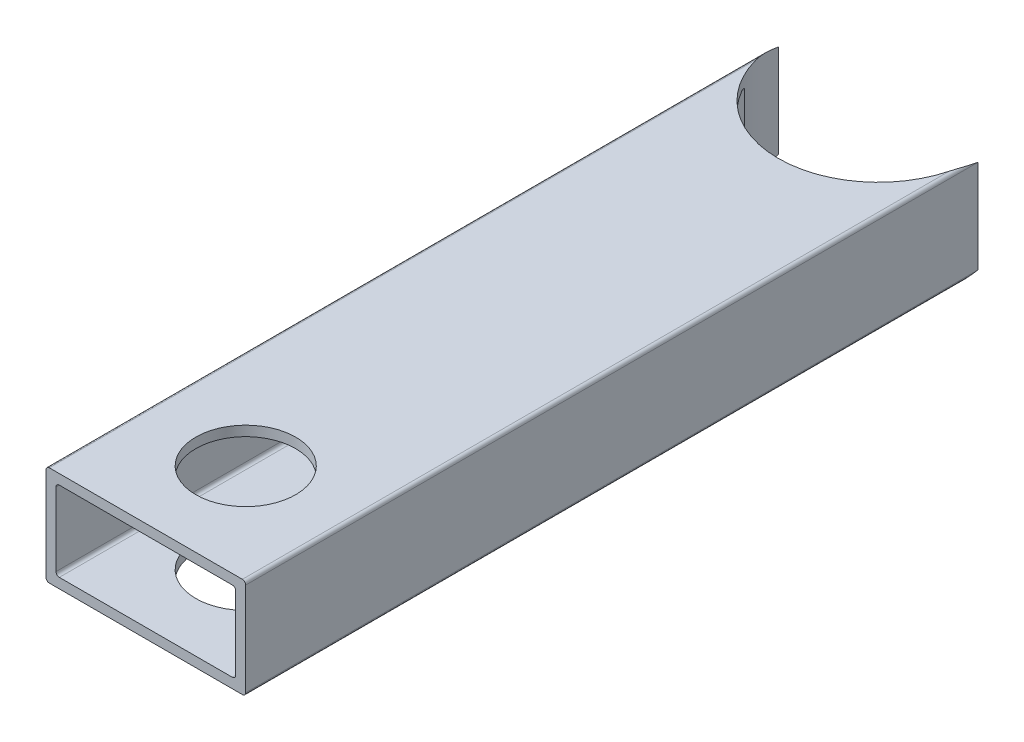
ISO-10303-21;
HEADER;
FILE_DESCRIPTION(('STEP AP214'),'2;1');
FILE_NAME('part.step','',(''),(''),'','','');
FILE_SCHEMA(('AUTOMOTIVE_DESIGN { 1 0 10303 214 1 1 1 1 }'));
ENDSEC;
DATA;
#1=APPLICATION_CONTEXT('core data for automotive mechanical design processes');
#2=APPLICATION_PROTOCOL_DEFINITION('international standard','automotive_design',2000,#1);
#3=PRODUCT_CONTEXT('',#1,'mechanical');
#4=PRODUCT('Part','Part','',(#3));
#5=PRODUCT_RELATED_PRODUCT_CATEGORY('part','',(#4));
#6=PRODUCT_DEFINITION_FORMATION('','',#4);
#7=PRODUCT_DEFINITION_CONTEXT('part definition',#1,'design');
#8=PRODUCT_DEFINITION('design','',#6,#7);
#9=PRODUCT_DEFINITION_SHAPE('','',#8);
#10=(LENGTH_UNIT() NAMED_UNIT(*) SI_UNIT(.MILLI.,.METRE.));
#11=(NAMED_UNIT(*) PLANE_ANGLE_UNIT() SI_UNIT($,.RADIAN.));
#12=(NAMED_UNIT(*) SI_UNIT($,.STERADIAN.) SOLID_ANGLE_UNIT());
#13=UNCERTAINTY_MEASURE_WITH_UNIT(LENGTH_MEASURE(1.E-05),#10,'distance_accuracy_value','');
#14=(GEOMETRIC_REPRESENTATION_CONTEXT(3) GLOBAL_UNCERTAINTY_ASSIGNED_CONTEXT((#13)) GLOBAL_UNIT_ASSIGNED_CONTEXT((#10,
#11,#12)) REPRESENTATION_CONTEXT('',''));
#15=CARTESIAN_POINT('',(0.,0.,0.));
#16=DIRECTION('',(0.,0.,1.));
#17=DIRECTION('',(1.,0.,0.));
#18=AXIS2_PLACEMENT_3D('',#15,#16,#17);
#19=CARTESIAN_POINT('',(59.,1.,220.));
#20=DIRECTION('',(0.,0.,-1.));
#21=DIRECTION('',(-1.,0.,0.));
#22=AXIS2_PLACEMENT_3D('',#19,#20,#21);
#23=PLANE('',#22);
#24=CARTESIAN_POINT('',(59.,1.,220.));
#25=DIRECTION('',(0.,0.,1.));
#26=DIRECTION('',(-1.,0.,0.));
#27=AXIS2_PLACEMENT_3D('',#24,#25,#26);
#28=CIRCLE('',#27,1.);
#29=CARTESIAN_POINT('',(59.,0.,220.));
#30=VERTEX_POINT('',#29);
#31=CARTESIAN_POINT('',(60.,1.00000000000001,220.));
#32=VERTEX_POINT('',#31);
#33=EDGE_CURVE('E196',#30,#32,#28,.T.);
#34=ORIENTED_EDGE('',*,*,#33,.T.);
#35=DIRECTION('',(0.,1.,0.));
#36=VECTOR('',#35,1.);
#37=CARTESIAN_POINT('',(60.,1.00000000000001,220.));
#38=LINE('',#37,#36);
#39=CARTESIAN_POINT('',(60.,29.,220.));
#40=VERTEX_POINT('',#39);
#41=EDGE_CURVE('E192',#32,#40,#38,.T.);
#42=ORIENTED_EDGE('',*,*,#41,.T.);
#43=CARTESIAN_POINT('',(59.,29.,220.));
#44=DIRECTION('',(0.,0.,1.));
#45=DIRECTION('',(1.,0.,0.));
#46=AXIS2_PLACEMENT_3D('',#43,#44,#45);
#47=CIRCLE('',#46,1.);
#48=CARTESIAN_POINT('',(59.,30.,220.));
#49=VERTEX_POINT('',#48);
#50=EDGE_CURVE('E309',#40,#49,#47,.T.);
#51=ORIENTED_EDGE('',*,*,#50,.T.);
#52=DIRECTION('',(-1.,0.,0.));
#53=VECTOR('',#52,1.);
#54=CARTESIAN_POINT('',(1.00000000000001,30.,220.));
#55=LINE('',#54,#53);
#56=CARTESIAN_POINT('',(1.00000000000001,30.,220.));
#57=VERTEX_POINT('',#56);
#58=EDGE_CURVE('E311',#49,#57,#55,.T.);
#59=ORIENTED_EDGE('',*,*,#58,.T.);
#60=CARTESIAN_POINT('',(1.,29.,220.));
#61=DIRECTION('',(0.,0.,1.));
#62=DIRECTION('',(1.,0.,0.));
#63=AXIS2_PLACEMENT_3D('',#60,#61,#62);
#64=CIRCLE('',#63,1.);
#65=CARTESIAN_POINT('',(0.,29.,220.));
#66=VERTEX_POINT('',#65);
#67=EDGE_CURVE('E313',#57,#66,#64,.T.);
#68=ORIENTED_EDGE('',*,*,#67,.T.);
#69=DIRECTION('',(0.,-1.,0.));
#70=VECTOR('',#69,1.);
#71=CARTESIAN_POINT('',(0.,1.00000000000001,220.));
#72=LINE('',#71,#70);
#73=CARTESIAN_POINT('',(0.,1.00000000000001,220.));
#74=VERTEX_POINT('',#73);
#75=EDGE_CURVE('E315',#66,#74,#72,.T.);
#76=ORIENTED_EDGE('',*,*,#75,.T.);
#77=CARTESIAN_POINT('',(1.,1.,220.));
#78=DIRECTION('',(0.,0.,1.));
#79=DIRECTION('',(1.,0.,0.));
#80=AXIS2_PLACEMENT_3D('',#77,#78,#79);
#81=CIRCLE('',#80,1.);
#82=CARTESIAN_POINT('',(1.00000000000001,0.,220.));
#83=VERTEX_POINT('',#82);
#84=EDGE_CURVE('E317',#74,#83,#81,.T.);
#85=ORIENTED_EDGE('',*,*,#84,.T.);
#86=DIRECTION('',(1.,0.,0.));
#87=VECTOR('',#86,1.);
#88=CARTESIAN_POINT('',(1.00000000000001,0.,220.));
#89=LINE('',#88,#87);
#90=EDGE_CURVE('E166',#83,#30,#89,.T.);
#91=ORIENTED_EDGE('',*,*,#90,.T.);
#92=EDGE_LOOP('',(#34,#42,#51,#59,#68,#76,#85,#91));
#93=FACE_BOUND('',#92,.T.);
#94=CARTESIAN_POINT('',(4.,26.,220.));
#95=DIRECTION('',(0.,0.,1.));
#96=DIRECTION('',(-1.,0.,0.));
#97=AXIS2_PLACEMENT_3D('',#94,#95,#96);
#98=CIRCLE('',#97,1.);
#99=CARTESIAN_POINT('',(4.00000000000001,27.,220.));
#100=VERTEX_POINT('',#99);
#101=CARTESIAN_POINT('',(3.,26.,220.));
#102=VERTEX_POINT('',#101);
#103=EDGE_CURVE('E197',#100,#102,#98,.T.);
#104=ORIENTED_EDGE('',*,*,#103,.F.);
#105=DIRECTION('',(-1.,0.,0.));
#106=VECTOR('',#105,1.);
#107=CARTESIAN_POINT('',(4.00000000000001,27.,220.));
#108=LINE('',#107,#106);
#109=CARTESIAN_POINT('',(56.,27.,220.));
#110=VERTEX_POINT('',#109);
#111=EDGE_CURVE('E366',#110,#100,#108,.T.);
#112=ORIENTED_EDGE('',*,*,#111,.F.);
#113=CARTESIAN_POINT('',(56.,26.,220.));
#114=DIRECTION('',(0.,0.,1.));
#115=DIRECTION('',(-1.,0.,0.));
#116=AXIS2_PLACEMENT_3D('',#113,#114,#115);
#117=CIRCLE('',#116,1.);
#118=CARTESIAN_POINT('',(57.,26.,220.));
#119=VERTEX_POINT('',#118);
#120=EDGE_CURVE('E360',#119,#110,#117,.T.);
#121=ORIENTED_EDGE('',*,*,#120,.F.);
#122=DIRECTION('',(0.,1.,0.));
#123=VECTOR('',#122,1.);
#124=CARTESIAN_POINT('',(57.,4.00000000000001,220.));
#125=LINE('',#124,#123);
#126=CARTESIAN_POINT('',(57.,4.00000000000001,220.));
#127=VERTEX_POINT('',#126);
#128=EDGE_CURVE('E399',#127,#119,#125,.T.);
#129=ORIENTED_EDGE('',*,*,#128,.F.);
#130=CARTESIAN_POINT('',(56.,4.,220.));
#131=DIRECTION('',(0.,0.,1.));
#132=DIRECTION('',(-1.,0.,0.));
#133=AXIS2_PLACEMENT_3D('',#130,#131,#132);
#134=CIRCLE('',#133,1.);
#135=CARTESIAN_POINT('',(56.,3.,220.));
#136=VERTEX_POINT('',#135);
#137=EDGE_CURVE('E397',#136,#127,#134,.T.);
#138=ORIENTED_EDGE('',*,*,#137,.F.);
#139=DIRECTION('',(1.,0.,0.));
#140=VECTOR('',#139,1.);
#141=CARTESIAN_POINT('',(4.00000000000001,3.,220.));
#142=LINE('',#141,#140);
#143=CARTESIAN_POINT('',(4.00000000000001,3.,220.));
#144=VERTEX_POINT('',#143);
#145=EDGE_CURVE('E393',#144,#136,#142,.T.);
#146=ORIENTED_EDGE('',*,*,#145,.F.);
#147=CARTESIAN_POINT('',(4.,4.,220.));
#148=DIRECTION('',(0.,0.,1.));
#149=DIRECTION('',(1.,0.,0.));
#150=AXIS2_PLACEMENT_3D('',#147,#148,#149);
#151=CIRCLE('',#150,1.);
#152=CARTESIAN_POINT('',(3.,4.00000000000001,220.));
#153=VERTEX_POINT('',#152);
#154=EDGE_CURVE('E392',#153,#144,#151,.T.);
#155=ORIENTED_EDGE('',*,*,#154,.F.);
#156=DIRECTION('',(0.,-1.,0.));
#157=VECTOR('',#156,1.);
#158=CARTESIAN_POINT('',(3.,4.00000000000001,220.));
#159=LINE('',#158,#157);
#160=EDGE_CURVE('E200',#102,#153,#159,.T.);
#161=ORIENTED_EDGE('',*,*,#160,.F.);
#162=EDGE_LOOP('',(#104,#112,#121,#129,#138,#146,#155,#161));
#163=FACE_BOUND('',#162,.T.);
#164=ADVANCED_FACE('F31',(#93,#163),#23,.F.);
#165=CARTESIAN_POINT('',(59.,1.,220.));
#166=DIRECTION('',(0.,0.,-1.));
#167=DIRECTION('',(-1.,0.,0.));
#168=AXIS2_PLACEMENT_3D('',#165,#166,#167);
#169=CYLINDRICAL_SURFACE('',#168,1.);
#170=DIRECTION('',(0.,0.,-1.));
#171=VECTOR('',#170,1.);
#172=CARTESIAN_POINT('',(59.,0.,220.));
#173=LINE('',#172,#171);
#174=CARTESIAN_POINT('',(59.,0.,7.68114574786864));
#175=VERTEX_POINT('',#174);
#176=EDGE_CURVE('E167',#30,#175,#173,.T.);
#177=ORIENTED_EDGE('',*,*,#176,.T.);
#178=CARTESIAN_POINT('',(59.,0.,7.68114574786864));
#179=CARTESIAN_POINT('',(59.0428048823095,3.21673729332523E-05,7.51954000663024));
#180=CARTESIAN_POINT('',(59.0842492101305,0.00274394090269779,7.35760653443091));
#181=CARTESIAN_POINT('',(59.1643842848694,0.0127708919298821,7.03324806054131));
#182=CARTESIAN_POINT('',(59.2030758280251,0.0200847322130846,6.87082321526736));
#183=CARTESIAN_POINT('',(59.3149691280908,0.047789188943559,6.3830888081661));
#184=CARTESIAN_POINT('',(59.3840349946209,0.0739443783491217,6.05714773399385));
#185=CARTESIAN_POINT('',(59.4935139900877,0.128751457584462,5.49459094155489));
#186=CARTESIAN_POINT('',(59.5365683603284,0.154711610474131,5.25820521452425));
#187=CARTESIAN_POINT('',(59.6169052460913,0.211428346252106,4.7850293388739));
#188=CARTESIAN_POINT('',(59.6541877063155,0.242184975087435,4.54823918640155));
#189=CARTESIAN_POINT('',(59.7574372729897,0.340217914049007,3.83723766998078));
#190=CARTESIAN_POINT('',(59.8147778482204,0.413241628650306,3.36254308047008));
#191=CARTESIAN_POINT('',(59.9066631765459,0.568602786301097,2.41235795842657));
#192=CARTESIAN_POINT('',(59.9411987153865,0.650943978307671,1.93686718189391));
#193=CARTESIAN_POINT('',(59.9875862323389,0.820105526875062,0.98558635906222));
#194=CARTESIAN_POINT('',(59.9994403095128,0.906925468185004,0.509796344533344));
#195=CARTESIAN_POINT('',(59.9999935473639,0.995852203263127,0.0227184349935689));
#196=CARTESIAN_POINT('',(59.999999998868,0.997926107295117,0.0113591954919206));
#197=CARTESIAN_POINT('',(60.,1.,0.));
#198=B_SPLINE_CURVE_WITH_KNOTS('',3,(#178,#179,#180,#181,#182,#183,#184,#185,#186,#187,#188,
#189,#190,#191,#192,#193,#194,#195,#196,#197),.UNSPECIFIED.,.F.,.F.,(4,2,2,2,2,2,2,2,2,4),(0.,
0.501459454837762,1.00277326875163,2.00486906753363,2.72978045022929,3.45469877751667,
4.90498893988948,6.35586472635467,7.8066062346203,7.84124725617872),.UNSPECIFIED.);
#199=CARTESIAN_POINT('',(60.,1.00000000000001,0.));
#200=VERTEX_POINT('',#199);
#201=EDGE_CURVE('E48',#175,#200,#198,.T.);
#202=ORIENTED_EDGE('',*,*,#201,.T.);
#203=DIRECTION('',(0.,0.,-1.));
#204=VECTOR('',#203,1.);
#205=CARTESIAN_POINT('',(60.,1.00000000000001,220.));
#206=LINE('',#205,#204);
#207=EDGE_CURVE('E41',#32,#200,#206,.T.);
#208=ORIENTED_EDGE('',*,*,#207,.F.);
#209=ORIENTED_EDGE('',*,*,#33,.F.);
#210=EDGE_LOOP('',(#177,#202,#208,#209));
#211=FACE_BOUND('',#210,.T.);
#212=ADVANCED_FACE('F33',(#211),#169,.T.);
#213=CARTESIAN_POINT('',(60.,1.00000000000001,220.));
#214=DIRECTION('',(-1.,0.,0.));
#215=DIRECTION('',(0.,0.,1.));
#216=AXIS2_PLACEMENT_3D('',#213,#214,#215);
#217=PLANE('',#216);
#218=DIRECTION('',(0.,1.,0.));
#219=VECTOR('',#218,1.);
#220=CARTESIAN_POINT('',(60.,1.00000000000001,0.));
#221=LINE('',#220,#219);
#222=CARTESIAN_POINT('',(60.,29.,0.));
#223=VERTEX_POINT('',#222);
#224=EDGE_CURVE('E191',#200,#223,#221,.T.);
#225=ORIENTED_EDGE('',*,*,#224,.T.);
#226=DIRECTION('',(0.,0.,-1.));
#227=VECTOR('',#226,1.);
#228=CARTESIAN_POINT('',(60.,29.,220.));
#229=LINE('',#228,#227);
#230=EDGE_CURVE('E182',#40,#223,#229,.T.);
#231=ORIENTED_EDGE('',*,*,#230,.F.);
#232=ORIENTED_EDGE('',*,*,#41,.F.);
#233=ORIENTED_EDGE('',*,*,#207,.T.);
#234=EDGE_LOOP('',(#225,#231,#232,#233));
#235=FACE_BOUND('',#234,.T.);
#236=ADVANCED_FACE('F189',(#235),#217,.F.);
#237=CARTESIAN_POINT('',(59.,29.,220.));
#238=DIRECTION('',(0.,0.,-1.));
#239=DIRECTION('',(-1.,0.,0.));
#240=AXIS2_PLACEMENT_3D('',#237,#238,#239);
#241=CYLINDRICAL_SURFACE('',#240,1.);
#242=ORIENTED_EDGE('',*,*,#230,.T.);
#243=CARTESIAN_POINT('',(59.,30.,7.68114574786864));
#244=CARTESIAN_POINT('',(59.0428048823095,29.9999678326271,7.51954000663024));
#245=CARTESIAN_POINT('',(59.0842492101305,29.9972560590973,7.35760653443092));
#246=CARTESIAN_POINT('',(59.1643842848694,29.9872291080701,7.03324806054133));
#247=CARTESIAN_POINT('',(59.203075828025,29.9799152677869,6.87082321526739));
#248=CARTESIAN_POINT('',(59.3149691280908,29.9522108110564,6.38308880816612));
#249=CARTESIAN_POINT('',(59.3840349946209,29.9260556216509,6.05714773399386));
#250=CARTESIAN_POINT('',(59.4935139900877,29.8712485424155,5.49459094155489));
#251=CARTESIAN_POINT('',(59.5365683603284,29.8452883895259,5.25820521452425));
#252=CARTESIAN_POINT('',(59.6169052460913,29.7885716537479,4.78502933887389));
#253=CARTESIAN_POINT('',(59.6541877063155,29.7578150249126,4.54823918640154));
#254=CARTESIAN_POINT('',(59.7574372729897,29.659782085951,3.83723766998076));
#255=CARTESIAN_POINT('',(59.8147778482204,29.5867583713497,3.36254308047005));
#256=CARTESIAN_POINT('',(59.9066631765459,29.4313972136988,2.41235795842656));
#257=CARTESIAN_POINT('',(59.9411987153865,29.3490560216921,1.93686718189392));
#258=CARTESIAN_POINT('',(59.9875862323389,29.1798944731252,0.985586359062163));
#259=CARTESIAN_POINT('',(59.9994403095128,29.0930745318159,0.509796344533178));
#260=CARTESIAN_POINT('',(59.9999935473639,29.0041477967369,0.0227184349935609));
#261=CARTESIAN_POINT('',(59.999999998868,29.0020738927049,0.0113591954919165));
#262=CARTESIAN_POINT('',(60.,29.,0.));
#263=B_SPLINE_CURVE_WITH_KNOTS('',3,(#243,#244,#245,#246,#247,#248,#249,#250,#251,#252,#253,
#254,#255,#256,#257,#258,#259,#260,#261,#262),.UNSPECIFIED.,.F.,.F.,(4,2,2,2,2,2,2,2,2,4),(0.,
0.501459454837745,1.0027732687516,2.00486906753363,2.72978045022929,3.45469877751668,
4.90498893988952,6.35586472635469,7.8066062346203,7.84124725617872),.UNSPECIFIED.);
#264=CARTESIAN_POINT('',(59.,30.,7.68114574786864));
#265=VERTEX_POINT('',#264);
#266=EDGE_CURVE('E198',#223,#265,#263,.F.);
#267=ORIENTED_EDGE('',*,*,#266,.T.);
#268=DIRECTION('',(0.,0.,-1.));
#269=VECTOR('',#268,1.);
#270=CARTESIAN_POINT('',(59.,30.,220.));
#271=LINE('',#270,#269);
#272=EDGE_CURVE('E179',#49,#265,#271,.T.);
#273=ORIENTED_EDGE('',*,*,#272,.F.);
#274=ORIENTED_EDGE('',*,*,#50,.F.);
#275=EDGE_LOOP('',(#242,#267,#273,#274));
#276=FACE_BOUND('',#275,.T.);
#277=ADVANCED_FACE('F270',(#276),#241,.T.);
#278=CARTESIAN_POINT('',(1.00000000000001,30.,220.));
#279=DIRECTION('',(0.,-1.,0.));
#280=DIRECTION('',(0.,0.,-1.));
#281=AXIS2_PLACEMENT_3D('',#278,#279,#280);
#282=PLANE('',#281);
#283=CARTESIAN_POINT('',(30.,30.,190.));
#284=DIRECTION('',(0.,1.,0.));
#285=DIRECTION('',(0.,0.,1.));
#286=AXIS2_PLACEMENT_3D('',#283,#284,#285);
#287=CIRCLE('',#286,15.);
#288=CARTESIAN_POINT('',(30.,30.,205.));
#289=VERTEX_POINT('',#288);
#290=EDGE_CURVE('E332',#289,#289,#287,.T.);
#291=ORIENTED_EDGE('',*,*,#290,.F.);
#292=EDGE_LOOP('',(#291));
#293=FACE_BOUND('',#292,.T.);
#294=ORIENTED_EDGE('',*,*,#272,.T.);
#295=CARTESIAN_POINT('',(30.,30.,0.));
#296=DIRECTION('',(0.,1.,0.));
#297=DIRECTION('',(0.,0.,1.));
#298=AXIS2_PLACEMENT_3D('',#295,#296,#297);
#299=CIRCLE('',#298,30.);
#300=CARTESIAN_POINT('',(1.,30.,7.68114574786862));
#301=VERTEX_POINT('',#300);
#302=EDGE_CURVE('E151',#301,#265,#299,.T.);
#303=ORIENTED_EDGE('',*,*,#302,.F.);
#304=DIRECTION('',(0.,0.,-1.));
#305=VECTOR('',#304,1.);
#306=CARTESIAN_POINT('',(1.00000000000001,30.,220.));
#307=LINE('',#306,#305);
#308=EDGE_CURVE('E176',#57,#301,#307,.T.);
#309=ORIENTED_EDGE('',*,*,#308,.F.);
#310=ORIENTED_EDGE('',*,*,#58,.F.);
#311=EDGE_LOOP('',(#294,#303,#309,#310));
#312=FACE_BOUND('',#311,.T.);
#313=ADVANCED_FACE('F267',(#293,#312),#282,.F.);
#314=CARTESIAN_POINT('',(1.,29.,220.));
#315=DIRECTION('',(0.,0.,-1.));
#316=DIRECTION('',(-1.,0.,0.));
#317=AXIS2_PLACEMENT_3D('',#314,#315,#316);
#318=CYLINDRICAL_SURFACE('',#317,1.);
#319=ORIENTED_EDGE('',*,*,#308,.T.);
#320=CARTESIAN_POINT('',(1.00000000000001,30.,7.68114574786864));
#321=CARTESIAN_POINT('',(0.957195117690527,29.9999678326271,7.51954000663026));
#322=CARTESIAN_POINT('',(0.915750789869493,29.9972560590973,7.35760653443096));
#323=CARTESIAN_POINT('',(0.83561571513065,29.9872291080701,7.0332480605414));
#324=CARTESIAN_POINT('',(0.796924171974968,29.9799152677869,6.87082321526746));
#325=CARTESIAN_POINT('',(0.685030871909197,29.9522108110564,6.38308880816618));
#326=CARTESIAN_POINT('',(0.615965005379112,29.9260556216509,6.05714773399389));
#327=CARTESIAN_POINT('',(0.506486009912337,29.8712485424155,5.49459094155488));
#328=CARTESIAN_POINT('',(0.463431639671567,29.8452883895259,5.25820521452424));
#329=CARTESIAN_POINT('',(0.383094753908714,29.7885716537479,4.78502933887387));
#330=CARTESIAN_POINT('',(0.345812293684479,29.7578150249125,4.54823918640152));
#331=CARTESIAN_POINT('',(0.242562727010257,29.659782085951,3.8372376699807));
#332=CARTESIAN_POINT('',(0.185222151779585,29.5867583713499,3.36254308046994));
#333=CARTESIAN_POINT('',(0.0933368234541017,29.4313972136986,2.4123579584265));
#334=CARTESIAN_POINT('',(0.0588012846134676,29.3490560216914,1.93686718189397));
#335=CARTESIAN_POINT('',(0.0124137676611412,29.1798944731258,0.985586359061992));
#336=CARTESIAN_POINT('',(0.000559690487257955,29.0930745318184,0.509796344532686));
#337=CARTESIAN_POINT('',(6.45263608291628E-06,29.004147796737,0.0227184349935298));
#338=CARTESIAN_POINT('',(1.13199910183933E-09,29.002073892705,0.0113591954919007));
#339=CARTESIAN_POINT('',(0.,29.,0.));
#340=B_SPLINE_CURVE_WITH_KNOTS('',3,(#320,#321,#322,#323,#324,#325,#326,#327,#328,#329,#330,
#331,#332,#333,#334,#335,#336,#337,#338,#339),.UNSPECIFIED.,.F.,.F.,(4,2,2,2,2,2,2,2,2,4),(0.,
0.501459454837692,1.00277326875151,2.00486906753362,2.72978045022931,3.45469877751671,
4.90498893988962,6.35586472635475,7.80660623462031,7.84124725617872),.UNSPECIFIED.);
#341=CARTESIAN_POINT('',(0.,29.,0.));
#342=VERTEX_POINT('',#341);
#343=EDGE_CURVE('E162',#301,#342,#340,.T.);
#344=ORIENTED_EDGE('',*,*,#343,.T.);
#345=DIRECTION('',(0.,0.,-1.));
#346=VECTOR('',#345,1.);
#347=CARTESIAN_POINT('',(0.,29.,220.));
#348=LINE('',#347,#346);
#349=EDGE_CURVE('E169',#66,#342,#348,.T.);
#350=ORIENTED_EDGE('',*,*,#349,.F.);
#351=ORIENTED_EDGE('',*,*,#67,.F.);
#352=EDGE_LOOP('',(#319,#344,#350,#351));
#353=FACE_BOUND('',#352,.T.);
#354=ADVANCED_FACE('F261',(#353),#318,.T.);
#355=CARTESIAN_POINT('',(0.,1.00000000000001,220.));
#356=DIRECTION('',(1.,0.,0.));
#357=DIRECTION('',(0.,0.,-1.));
#358=AXIS2_PLACEMENT_3D('',#355,#356,#357);
#359=PLANE('',#358);
#360=DIRECTION('',(0.,-1.,0.));
#361=VECTOR('',#360,1.);
#362=CARTESIAN_POINT('',(0.,1.00000000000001,0.));
#363=LINE('',#362,#361);
#364=CARTESIAN_POINT('',(0.,1.,0.));
#365=VERTEX_POINT('',#364);
#366=EDGE_CURVE('E299',#342,#365,#363,.T.);
#367=ORIENTED_EDGE('',*,*,#366,.T.);
#368=DIRECTION('',(0.,0.,-1.));
#369=VECTOR('',#368,1.);
#370=CARTESIAN_POINT('',(0.,1.00000000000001,220.));
#371=LINE('',#370,#369);
#372=EDGE_CURVE('E161',#74,#365,#371,.T.);
#373=ORIENTED_EDGE('',*,*,#372,.F.);
#374=ORIENTED_EDGE('',*,*,#75,.F.);
#375=ORIENTED_EDGE('',*,*,#349,.T.);
#376=EDGE_LOOP('',(#367,#373,#374,#375));
#377=FACE_BOUND('',#376,.T.);
#378=ADVANCED_FACE('F266',(#377),#359,.F.);
#379=CARTESIAN_POINT('',(1.,1.,220.));
#380=DIRECTION('',(0.,0.,-1.));
#381=DIRECTION('',(-1.,0.,0.));
#382=AXIS2_PLACEMENT_3D('',#379,#380,#381);
#383=CYLINDRICAL_SURFACE('',#382,1.);
#384=ORIENTED_EDGE('',*,*,#372,.T.);
#385=CARTESIAN_POINT('',(1.00000000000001,0.,7.68114574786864));
#386=CARTESIAN_POINT('',(0.957195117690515,3.21673729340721E-05,7.51954000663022));
#387=CARTESIAN_POINT('',(0.915750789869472,0.00274394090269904,7.35760653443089));
#388=CARTESIAN_POINT('',(0.835615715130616,0.0127708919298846,7.03324806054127));
#389=CARTESIAN_POINT('',(0.79692417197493,0.0200847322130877,6.87082321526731));
#390=CARTESIAN_POINT('',(0.685030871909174,0.0477891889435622,6.38308880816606));
#391=CARTESIAN_POINT('',(0.615965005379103,0.0739443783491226,6.05714773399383));
#392=CARTESIAN_POINT('',(0.506486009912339,0.128751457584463,5.4945909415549));
#393=CARTESIAN_POINT('',(0.463431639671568,0.154711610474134,5.25820521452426));
#394=CARTESIAN_POINT('',(0.383094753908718,0.211428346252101,4.78502933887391));
#395=CARTESIAN_POINT('',(0.345812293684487,0.24218497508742,4.54823918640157));
#396=CARTESIAN_POINT('',(0.242562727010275,0.340217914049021,3.83723766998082));
#397=CARTESIAN_POINT('',(0.185222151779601,0.413241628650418,3.36254308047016));
#398=CARTESIAN_POINT('',(0.0933368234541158,0.568602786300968,2.41235795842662));
#399=CARTESIAN_POINT('',(0.0588012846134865,0.650943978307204,1.93686718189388));
#400=CARTESIAN_POINT('',(0.0124137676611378,0.820105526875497,0.985586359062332));
#401=CARTESIAN_POINT('',(0.000559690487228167,0.90692546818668,0.509796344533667));
#402=CARTESIAN_POINT('',(6.45263608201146E-06,0.995852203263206,0.0227184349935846));
#403=CARTESIAN_POINT('',(1.13199890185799E-09,0.997926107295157,0.0113591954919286));
#404=CARTESIAN_POINT('',(0.,1.,0.));
#405=B_SPLINE_CURVE_WITH_KNOTS('',3,(#385,#386,#387,#388,#389,#390,#391,#392,#393,#394,#395,
#396,#397,#398,#399,#400,#401,#402,#403,#404),.UNSPECIFIED.,.F.,.F.,(4,2,2,2,2,2,2,2,2,4),(0.,
0.501459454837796,1.00277326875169,2.00486906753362,2.72978045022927,3.45469877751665,
4.90498893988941,6.35586472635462,7.8066062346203,7.84124725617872),.UNSPECIFIED.);
#406=CARTESIAN_POINT('',(1.00000000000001,0.,7.68114574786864));
#407=VERTEX_POINT('',#406);
#408=EDGE_CURVE('E145',#365,#407,#405,.F.);
#409=ORIENTED_EDGE('',*,*,#408,.T.);
#410=DIRECTION('',(0.,0.,-1.));
#411=VECTOR('',#410,1.);
#412=CARTESIAN_POINT('',(1.00000000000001,0.,220.));
#413=LINE('',#412,#411);
#414=EDGE_CURVE('E158',#83,#407,#413,.T.);
#415=ORIENTED_EDGE('',*,*,#414,.F.);
#416=ORIENTED_EDGE('',*,*,#84,.F.);
#417=EDGE_LOOP('',(#384,#409,#415,#416));
#418=FACE_BOUND('',#417,.T.);
#419=ADVANCED_FACE('F156',(#418),#383,.T.);
#420=CARTESIAN_POINT('',(1.00000000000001,0.,220.));
#421=DIRECTION('',(0.,1.,0.));
#422=DIRECTION('',(0.,0.,1.));
#423=AXIS2_PLACEMENT_3D('',#420,#421,#422);
#424=PLANE('',#423);
#425=CARTESIAN_POINT('',(30.,0.,190.));
#426=DIRECTION('',(0.,1.,0.));
#427=DIRECTION('',(0.,0.,1.));
#428=AXIS2_PLACEMENT_3D('',#425,#426,#427);
#429=CIRCLE('',#428,15.);
#430=CARTESIAN_POINT('',(30.,0.,205.));
#431=VERTEX_POINT('',#430);
#432=EDGE_CURVE('E329',#431,#431,#429,.T.);
#433=ORIENTED_EDGE('',*,*,#432,.T.);
#434=EDGE_LOOP('',(#433));
#435=FACE_BOUND('',#434,.T.);
#436=ORIENTED_EDGE('',*,*,#414,.T.);
#437=CARTESIAN_POINT('',(30.,0.,0.));
#438=DIRECTION('',(0.,1.,0.));
#439=DIRECTION('',(0.,0.,1.));
#440=AXIS2_PLACEMENT_3D('',#437,#438,#439);
#441=CIRCLE('',#440,30.);
#442=EDGE_CURVE('E142',#407,#175,#441,.T.);
#443=ORIENTED_EDGE('',*,*,#442,.T.);
#444=ORIENTED_EDGE('',*,*,#176,.F.);
#445=ORIENTED_EDGE('',*,*,#90,.F.);
#446=EDGE_LOOP('',(#436,#443,#444,#445));
#447=FACE_BOUND('',#446,.T.);
#448=ADVANCED_FACE('F165',(#435,#447),#424,.F.);
#449=CARTESIAN_POINT('',(4.,26.,220.));
#450=DIRECTION('',(0.,0.,-1.));
#451=DIRECTION('',(-1.,0.,0.));
#452=AXIS2_PLACEMENT_3D('',#449,#450,#451);
#453=CYLINDRICAL_SURFACE('',#452,1.);
#454=CARTESIAN_POINT('',(4.00000000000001,27.,14.9666295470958));
#455=CARTESIAN_POINT('',(3.97235703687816,26.9999955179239,14.9186085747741));
#456=CARTESIAN_POINT('',(3.94485166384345,26.9988544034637,14.8705181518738));
#457=CARTESIAN_POINT('',(3.89015104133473,26.994327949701,14.7742631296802));
#458=CARTESIAN_POINT('',(3.86295580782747,26.9909424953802,14.7260985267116));
#459=CARTESIAN_POINT('',(3.78169961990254,26.9774313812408,14.5812550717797));
#460=CARTESIAN_POINT('',(3.72816548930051,26.9639513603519,14.4845693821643));
#461=CARTESIAN_POINT('',(3.62313672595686,26.9279237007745,14.2924113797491));
#462=CARTESIAN_POINT('',(3.5716334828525,26.9054202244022,14.1969354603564));
#463=CARTESIAN_POINT('',(3.47089989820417,26.8505005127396,14.0077933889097));
#464=CARTESIAN_POINT('',(3.42166548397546,26.8181029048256,13.9141241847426));
#465=CARTESIAN_POINT('',(3.3471270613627,26.7582416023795,13.7705394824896));
#466=CARTESIAN_POINT('',(3.32080144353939,26.7348499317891,13.7194588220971));
#467=CARTESIAN_POINT('',(3.26921796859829,26.6835839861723,13.6186825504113));
#468=CARTESIAN_POINT('',(3.24396546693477,26.6556899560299,13.5689942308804));
#469=CARTESIAN_POINT('',(3.18907546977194,26.5871843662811,13.4602686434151));
#470=CARTESIAN_POINT('',(3.15985585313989,26.5451287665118,13.4018791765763));
#471=CARTESIAN_POINT('',(3.11912250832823,26.4741151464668,13.3198861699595));
#472=CARTESIAN_POINT('',(3.1060903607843,26.4491965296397,13.2935477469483));
#473=CARTESIAN_POINT('',(3.08140363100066,26.3962749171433,13.2434866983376));
#474=CARTESIAN_POINT('',(3.0697464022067,26.3682780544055,13.219759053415));
#475=CARTESIAN_POINT('',(3.05051081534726,26.3148094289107,13.1804936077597));
#476=CARTESIAN_POINT('',(3.04258440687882,26.2899730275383,13.1642701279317));
#477=CARTESIAN_POINT('',(3.02835750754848,26.2379804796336,13.1350966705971));
#478=CARTESIAN_POINT('',(3.02205594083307,26.2108258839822,13.1221445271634));
#479=CARTESIAN_POINT('',(3.01231838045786,26.158405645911,13.1021047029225));
#480=CARTESIAN_POINT('',(3.00860374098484,26.1334128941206,13.0944478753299));
#481=CARTESIAN_POINT('',(3.00307162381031,26.0823767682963,13.0830386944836));
#482=CARTESIAN_POINT('',(3.00124904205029,26.0563364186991,13.0792758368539));
#483=CARTESIAN_POINT('',(3.0001502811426,26.0201184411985,13.077007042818));
#484=CARTESIAN_POINT('',(2.99999698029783,26.0100574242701,13.0766904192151));
#485=CARTESIAN_POINT('',(3.,26.,13.076696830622));
#486=B_SPLINE_CURVE_WITH_KNOTS('',3,(#454,#455,#456,#457,#458,#459,#460,#461,#462,#463,#464,
#465,#466,#467,#468,#469,#470,#471,#472,#473,#474,#475,#476,#477,#478,#479,#480,#481,#482,#483,
#484,#485),.UNSPECIFIED.,.F.,.F.,(4,2,2,2,2,2,2,2,2,2,2,2,2,2,2,4),(0.,0.166198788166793,
0.332406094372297,0.666003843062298,0.997988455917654,1.32935186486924,1.51532692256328,
1.70214135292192,1.93416868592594,2.04958927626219,2.16478393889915,2.25666936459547,
2.34849379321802,2.42738097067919,2.50605478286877,2.53623217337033),.UNSPECIFIED.);
#487=CARTESIAN_POINT('',(4.00000000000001,27.,14.9666295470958));
#488=VERTEX_POINT('',#487);
#489=CARTESIAN_POINT('',(3.,26.,13.076696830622));
#490=VERTEX_POINT('',#489);
#491=EDGE_CURVE('E163',#488,#490,#486,.T.);
#492=ORIENTED_EDGE('',*,*,#491,.F.);
#493=DIRECTION('',(0.,0.,-1.));
#494=VECTOR('',#493,1.);
#495=CARTESIAN_POINT('',(4.00000000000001,27.,220.));
#496=LINE('',#495,#494);
#497=EDGE_CURVE('E354',#100,#488,#496,.T.);
#498=ORIENTED_EDGE('',*,*,#497,.F.);
#499=ORIENTED_EDGE('',*,*,#103,.T.);
#500=DIRECTION('',(0.,0.,-1.));
#501=VECTOR('',#500,1.);
#502=CARTESIAN_POINT('',(3.,26.,220.));
#503=LINE('',#502,#501);
#504=EDGE_CURVE('E304',#102,#490,#503,.T.);
#505=ORIENTED_EDGE('',*,*,#504,.T.);
#506=EDGE_LOOP('',(#492,#498,#499,#505));
#507=FACE_BOUND('',#506,.T.);
#508=ADVANCED_FACE('F286',(#507),#453,.F.);
#509=CARTESIAN_POINT('',(3.,4.00000000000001,220.));
#510=DIRECTION('',(1.,0.,0.));
#511=DIRECTION('',(0.,0.,-1.));
#512=AXIS2_PLACEMENT_3D('',#509,#510,#511);
#513=PLANE('',#512);
#514=DIRECTION('',(0.,1.,0.));
#515=VECTOR('',#514,1.);
#516=CARTESIAN_POINT('',(3.,0.,13.076696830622));
#517=LINE('',#516,#515);
#518=CARTESIAN_POINT('',(3.,4.00000000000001,13.076696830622));
#519=VERTEX_POINT('',#518);
#520=EDGE_CURVE('E389',#490,#519,#517,.F.);
#521=ORIENTED_EDGE('',*,*,#520,.F.);
#522=ORIENTED_EDGE('',*,*,#504,.F.);
#523=ORIENTED_EDGE('',*,*,#160,.T.);
#524=DIRECTION('',(0.,0.,-1.));
#525=VECTOR('',#524,1.);
#526=CARTESIAN_POINT('',(3.,4.00000000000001,220.));
#527=LINE('',#526,#525);
#528=EDGE_CURVE('E378',#153,#519,#527,.T.);
#529=ORIENTED_EDGE('',*,*,#528,.T.);
#530=EDGE_LOOP('',(#521,#522,#523,#529));
#531=FACE_BOUND('',#530,.T.);
#532=ADVANCED_FACE('F387',(#531),#513,.T.);
#533=CARTESIAN_POINT('',(4.,4.,220.));
#534=DIRECTION('',(0.,0.,-1.));
#535=DIRECTION('',(-1.,0.,0.));
#536=AXIS2_PLACEMENT_3D('',#533,#534,#535);
#537=CYLINDRICAL_SURFACE('',#536,1.);
#538=CARTESIAN_POINT('',(3.,4.00000000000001,13.076696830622));
#539=CARTESIAN_POINT('',(2.99996835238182,3.97294687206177,13.0766291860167));
#540=CARTESIAN_POINT('',(3.00109618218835,3.94599351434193,13.078960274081));
#541=CARTESIAN_POINT('',(3.00537384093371,3.89326211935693,13.0877880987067));
#542=CARTESIAN_POINT('',(3.00849930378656,3.86747387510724,13.0942346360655));
#543=CARTESIAN_POINT('',(3.0175008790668,3.8110147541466,13.1127748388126));
#544=CARTESIAN_POINT('',(3.02387362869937,3.78076472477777,13.12588618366));
#545=CARTESIAN_POINT('',(3.03869327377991,3.72289564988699,13.15630000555));
#546=CARTESIAN_POINT('',(3.04715056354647,3.69529078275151,13.1736234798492));
#547=CARTESIAN_POINT('',(3.07139941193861,3.62613540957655,13.2231472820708));
#548=CARTESIAN_POINT('',(3.08844425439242,3.58682180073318,13.2578221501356));
#549=CARTESIAN_POINT('',(3.12498779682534,3.5141926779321,13.3317455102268));
#550=CARTESIAN_POINT('',(3.14449163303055,3.48089008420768,13.3710035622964));
#551=CARTESIAN_POINT('',(3.18511447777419,3.41920797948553,13.4522851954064));
#552=CARTESIAN_POINT('',(3.20623106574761,3.39082129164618,13.4943046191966));
#553=CARTESIAN_POINT('',(3.2496726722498,3.33805057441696,13.5802176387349));
#554=CARTESIAN_POINT('',(3.2719988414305,3.31367044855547,13.6241130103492));
#555=CARTESIAN_POINT('',(3.31767777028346,3.26823648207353,13.7133586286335));
#556=CARTESIAN_POINT('',(3.34103467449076,3.24719800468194,13.7587145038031));
#557=CARTESIAN_POINT('',(3.38851513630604,3.20814788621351,13.850326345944));
#558=CARTESIAN_POINT('',(3.41263894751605,3.19013725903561,13.8965826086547));
#559=CARTESIAN_POINT('',(3.48137067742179,3.14331888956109,14.0275215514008));
#560=CARTESIAN_POINT('',(3.52671803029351,3.11760701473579,14.1129316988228));
#561=CARTESIAN_POINT('',(3.61910323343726,3.07397415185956,14.2848814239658));
#562=CARTESIAN_POINT('',(3.66614271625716,3.05606091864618,14.371422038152));
#563=CARTESIAN_POINT('',(3.76046032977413,3.02789696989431,14.5428986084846));
#564=CARTESIAN_POINT('',(3.807706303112,3.01747449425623,14.6278239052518));
#565=CARTESIAN_POINT('',(3.8793200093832,3.00701677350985,14.7550819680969));
#566=CARTESIAN_POINT('',(3.90329245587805,3.00439357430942,14.7974398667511));
#567=CARTESIAN_POINT('',(3.95147463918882,3.0008865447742,14.8820932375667));
#568=CARTESIAN_POINT('',(3.975684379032,3.00000273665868,14.9243887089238));
#569=CARTESIAN_POINT('',(4.00000000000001,3.,14.9666295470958));
#570=B_SPLINE_CURVE_WITH_KNOTS('',3,(#538,#539,#540,#541,#542,#543,#544,#545,#546,#547,#548,
#549,#550,#551,#552,#553,#554,#555,#556,#557,#558,#559,#560,#561,#562,#563,#564,#565,#566,#567,
#568,#569),.UNSPECIFIED.,.F.,.F.,(4,2,2,2,2,2,2,2,2,2,2,2,2,2,2,4),(0.,0.0808747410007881,
0.160781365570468,0.26095781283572,0.361644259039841,0.526082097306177,0.690869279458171,
0.855413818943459,1.02011773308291,1.18555822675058,1.35105400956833,1.6508240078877,
1.9508914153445,2.24383753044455,2.39003562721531,2.53623559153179),.UNSPECIFIED.);
#571=CARTESIAN_POINT('',(4.00000000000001,3.,14.9666295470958));
#572=VERTEX_POINT('',#571);
#573=EDGE_CURVE('E239',#519,#572,#570,.T.);
#574=ORIENTED_EDGE('',*,*,#573,.F.);
#575=ORIENTED_EDGE('',*,*,#528,.F.);
#576=ORIENTED_EDGE('',*,*,#154,.T.);
#577=DIRECTION('',(0.,0.,-1.));
#578=VECTOR('',#577,1.);
#579=CARTESIAN_POINT('',(4.00000000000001,3.,220.));
#580=LINE('',#579,#578);
#581=EDGE_CURVE('E375',#144,#572,#580,.T.);
#582=ORIENTED_EDGE('',*,*,#581,.T.);
#583=EDGE_LOOP('',(#574,#575,#576,#582));
#584=FACE_BOUND('',#583,.T.);
#585=ADVANCED_FACE('F419',(#584),#537,.F.);
#586=CARTESIAN_POINT('',(4.00000000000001,3.,220.));
#587=DIRECTION('',(0.,1.,0.));
#588=DIRECTION('',(0.,0.,1.));
#589=AXIS2_PLACEMENT_3D('',#586,#587,#588);
#590=PLANE('',#589);
#591=CARTESIAN_POINT('',(30.,3.,190.));
#592=DIRECTION('',(0.,1.,0.));
#593=DIRECTION('',(0.,0.,1.));
#594=AXIS2_PLACEMENT_3D('',#591,#592,#593);
#595=CIRCLE('',#594,15.);
#596=CARTESIAN_POINT('',(30.,3.,205.));
#597=VERTEX_POINT('',#596);
#598=EDGE_CURVE('E324',#597,#597,#595,.T.);
#599=ORIENTED_EDGE('',*,*,#598,.F.);
#600=EDGE_LOOP('',(#599));
#601=FACE_BOUND('',#600,.T.);
#602=CARTESIAN_POINT('',(30.,3.,0.));
#603=DIRECTION('',(0.,1.,0.));
#604=DIRECTION('',(0.,0.,1.));
#605=AXIS2_PLACEMENT_3D('',#602,#603,#604);
#606=CIRCLE('',#605,30.);
#607=CARTESIAN_POINT('',(56.,3.,14.9666295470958));
#608=VERTEX_POINT('',#607);
#609=EDGE_CURVE('E416',#572,#608,#606,.T.);
#610=ORIENTED_EDGE('',*,*,#609,.F.);
#611=ORIENTED_EDGE('',*,*,#581,.F.);
#612=ORIENTED_EDGE('',*,*,#145,.T.);
#613=DIRECTION('',(0.,0.,-1.));
#614=VECTOR('',#613,1.);
#615=CARTESIAN_POINT('',(56.,3.,220.));
#616=LINE('',#615,#614);
#617=EDGE_CURVE('E372',#136,#608,#616,.T.);
#618=ORIENTED_EDGE('',*,*,#617,.T.);
#619=EDGE_LOOP('',(#610,#611,#612,#618));
#620=FACE_BOUND('',#619,.T.);
#621=ADVANCED_FACE('F414',(#601,#620),#590,.T.);
#622=CARTESIAN_POINT('',(56.,4.,220.));
#623=DIRECTION('',(0.,0.,-1.));
#624=DIRECTION('',(-1.,0.,0.));
#625=AXIS2_PLACEMENT_3D('',#622,#623,#624);
#626=CYLINDRICAL_SURFACE('',#625,1.);
#627=CARTESIAN_POINT('',(56.,3.,14.9666295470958));
#628=CARTESIAN_POINT('',(56.0276429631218,3.00000448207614,14.9186085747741));
#629=CARTESIAN_POINT('',(56.0551483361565,3.00114559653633,14.8705181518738));
#630=CARTESIAN_POINT('',(56.1098489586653,3.00567205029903,14.7742631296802));
#631=CARTESIAN_POINT('',(56.1370441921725,3.00905750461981,14.7260985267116));
#632=CARTESIAN_POINT('',(56.2183003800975,3.02256861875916,14.5812550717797));
#633=CARTESIAN_POINT('',(56.2718345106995,3.03604863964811,14.4845693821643));
#634=CARTESIAN_POINT('',(56.3768632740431,3.07207629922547,14.2924113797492));
#635=CARTESIAN_POINT('',(56.4283665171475,3.0945797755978,14.1969354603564));
#636=CARTESIAN_POINT('',(56.5291001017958,3.14949948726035,14.0077933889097));
#637=CARTESIAN_POINT('',(56.5783345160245,3.18189709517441,13.9141241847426));
#638=CARTESIAN_POINT('',(56.6528729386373,3.24175839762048,13.7705394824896));
#639=CARTESIAN_POINT('',(56.6791985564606,3.26515006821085,13.7194588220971));
#640=CARTESIAN_POINT('',(56.7307820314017,3.31641601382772,13.6186825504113));
#641=CARTESIAN_POINT('',(56.7560345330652,3.34431004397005,13.5689942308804));
#642=CARTESIAN_POINT('',(56.8109245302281,3.41281563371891,13.4602686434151));
#643=CARTESIAN_POINT('',(56.8401441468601,3.45487123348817,13.4018791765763));
#644=CARTESIAN_POINT('',(56.8808774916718,3.52588485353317,13.3198861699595));
#645=CARTESIAN_POINT('',(56.8939096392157,3.55080347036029,13.2935477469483));
#646=CARTESIAN_POINT('',(56.9185963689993,3.60372508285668,13.2434866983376));
#647=CARTESIAN_POINT('',(56.9302535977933,3.63172194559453,13.219759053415));
#648=CARTESIAN_POINT('',(56.9494891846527,3.68519057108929,13.1804936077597));
#649=CARTESIAN_POINT('',(56.9574155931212,3.71002697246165,13.1642701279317));
#650=CARTESIAN_POINT('',(56.9716424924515,3.76201952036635,13.1350966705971));
#651=CARTESIAN_POINT('',(56.9779440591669,3.78917411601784,13.1221445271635));
#652=CARTESIAN_POINT('',(56.9876816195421,3.84159435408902,13.1021047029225));
#653=CARTESIAN_POINT('',(56.9913962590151,3.86658710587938,13.0944478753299));
#654=CARTESIAN_POINT('',(56.9969283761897,3.91762323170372,13.0830386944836));
#655=CARTESIAN_POINT('',(56.9987509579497,3.94366358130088,13.0792758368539));
#656=CARTESIAN_POINT('',(56.9998497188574,3.97988155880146,13.0770070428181));
#657=CARTESIAN_POINT('',(57.0000030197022,3.98994257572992,13.0766904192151));
#658=CARTESIAN_POINT('',(57.,4.00000000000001,13.076696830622));
#659=B_SPLINE_CURVE_WITH_KNOTS('',3,(#627,#628,#629,#630,#631,#632,#633,#634,#635,#636,#637,
#638,#639,#640,#641,#642,#643,#644,#645,#646,#647,#648,#649,#650,#651,#652,#653,#654,#655,#656,
#657,#658),.UNSPECIFIED.,.F.,.F.,(4,2,2,2,2,2,2,2,2,2,2,2,2,2,2,4),(0.,0.166198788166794,
0.332406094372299,0.666003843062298,0.997988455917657,1.32935186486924,1.51532692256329,
1.70214135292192,1.93416868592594,2.04958927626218,2.16478393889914,2.25666936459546,
2.34849379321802,2.42738097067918,2.50605478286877,2.53623217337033),.UNSPECIFIED.);
#660=CARTESIAN_POINT('',(57.,4.00000000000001,13.076696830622));
#661=VERTEX_POINT('',#660);
#662=EDGE_CURVE('E231',#608,#661,#659,.T.);
#663=ORIENTED_EDGE('',*,*,#662,.F.);
#664=ORIENTED_EDGE('',*,*,#617,.F.);
#665=ORIENTED_EDGE('',*,*,#137,.T.);
#666=DIRECTION('',(0.,0.,-1.));
#667=VECTOR('',#666,1.);
#668=CARTESIAN_POINT('',(57.,4.00000000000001,220.));
#669=LINE('',#668,#667);
#670=EDGE_CURVE('E364',#127,#661,#669,.T.);
#671=ORIENTED_EDGE('',*,*,#670,.T.);
#672=EDGE_LOOP('',(#663,#664,#665,#671));
#673=FACE_BOUND('',#672,.T.);
#674=ADVANCED_FACE('F410',(#673),#626,.F.);
#675=CARTESIAN_POINT('',(57.,4.00000000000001,220.));
#676=DIRECTION('',(-1.,0.,0.));
#677=DIRECTION('',(0.,0.,1.));
#678=AXIS2_PLACEMENT_3D('',#675,#676,#677);
#679=PLANE('',#678);
#680=DIRECTION('',(0.,1.,0.));
#681=VECTOR('',#680,1.);
#682=CARTESIAN_POINT('',(57.,0.,13.076696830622));
#683=LINE('',#682,#681);
#684=CARTESIAN_POINT('',(57.,26.,13.076696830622));
#685=VERTEX_POINT('',#684);
#686=EDGE_CURVE('E407',#661,#685,#683,.T.);
#687=ORIENTED_EDGE('',*,*,#686,.F.);
#688=ORIENTED_EDGE('',*,*,#670,.F.);
#689=ORIENTED_EDGE('',*,*,#128,.T.);
#690=DIRECTION('',(0.,0.,-1.));
#691=VECTOR('',#690,1.);
#692=CARTESIAN_POINT('',(57.,26.,220.));
#693=LINE('',#692,#691);
#694=EDGE_CURVE('E362',#119,#685,#693,.T.);
#695=ORIENTED_EDGE('',*,*,#694,.T.);
#696=EDGE_LOOP('',(#687,#688,#689,#695));
#697=FACE_BOUND('',#696,.T.);
#698=ADVANCED_FACE('F406',(#697),#679,.T.);
#699=CARTESIAN_POINT('',(56.,26.,220.));
#700=DIRECTION('',(0.,0.,-1.));
#701=DIRECTION('',(-1.,0.,0.));
#702=AXIS2_PLACEMENT_3D('',#699,#700,#701);
#703=CYLINDRICAL_SURFACE('',#702,1.);
#704=CARTESIAN_POINT('',(57.,26.,13.076696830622));
#705=CARTESIAN_POINT('',(57.0000316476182,26.0270531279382,13.0766291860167));
#706=CARTESIAN_POINT('',(56.9989038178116,26.0540064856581,13.078960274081));
#707=CARTESIAN_POINT('',(56.9946261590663,26.1067378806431,13.0877880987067));
#708=CARTESIAN_POINT('',(56.9915006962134,26.1325261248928,13.0942346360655));
#709=CARTESIAN_POINT('',(56.9824991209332,26.1889852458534,13.1127748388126));
#710=CARTESIAN_POINT('',(56.9761263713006,26.2192352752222,13.12588618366));
#711=CARTESIAN_POINT('',(56.9613067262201,26.277104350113,13.15630000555));
#712=CARTESIAN_POINT('',(56.9528494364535,26.3047092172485,13.1736234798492));
#713=CARTESIAN_POINT('',(56.9286005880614,26.3738645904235,13.2231472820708));
#714=CARTESIAN_POINT('',(56.9115557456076,26.4131781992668,13.2578221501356));
#715=CARTESIAN_POINT('',(56.8750122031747,26.4858073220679,13.3317455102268));
#716=CARTESIAN_POINT('',(56.8555083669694,26.5191099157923,13.3710035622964));
#717=CARTESIAN_POINT('',(56.8148855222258,26.5807920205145,13.4522851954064));
#718=CARTESIAN_POINT('',(56.7937689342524,26.6091787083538,13.4943046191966));
#719=CARTESIAN_POINT('',(56.7503273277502,26.661949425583,13.5802176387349));
#720=CARTESIAN_POINT('',(56.7280011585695,26.6863295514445,13.6241130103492));
#721=CARTESIAN_POINT('',(56.6823222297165,26.7317635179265,13.7133586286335));
#722=CARTESIAN_POINT('',(56.6589653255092,26.7528019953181,13.7587145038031));
#723=CARTESIAN_POINT('',(56.6114848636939,26.7918521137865,13.850326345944));
#724=CARTESIAN_POINT('',(56.5873610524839,26.8098627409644,13.8965826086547));
#725=CARTESIAN_POINT('',(56.5186293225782,26.8566811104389,14.0275215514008));
#726=CARTESIAN_POINT('',(56.4732819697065,26.8823929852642,14.1129316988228));
#727=CARTESIAN_POINT('',(56.3808967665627,26.9260258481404,14.2848814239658));
#728=CARTESIAN_POINT('',(56.3338572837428,26.9439390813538,14.3714220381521));
#729=CARTESIAN_POINT('',(56.2395396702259,26.9721030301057,14.5428986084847));
#730=CARTESIAN_POINT('',(56.192293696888,26.9825255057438,14.6278239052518));
#731=CARTESIAN_POINT('',(56.1206799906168,26.9929832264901,14.7550819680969));
#732=CARTESIAN_POINT('',(56.0967075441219,26.9956064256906,14.7974398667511));
#733=CARTESIAN_POINT('',(56.0485253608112,26.9991134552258,14.8820932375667));
#734=CARTESIAN_POINT('',(56.024315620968,26.9999972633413,14.9243887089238));
#735=CARTESIAN_POINT('',(56.,27.,14.9666295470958));
#736=B_SPLINE_CURVE_WITH_KNOTS('',3,(#704,#705,#706,#707,#708,#709,#710,#711,#712,#713,#714,
#715,#716,#717,#718,#719,#720,#721,#722,#723,#724,#725,#726,#727,#728,#729,#730,#731,#732,#733,
#734,#735),.UNSPECIFIED.,.F.,.F.,(4,2,2,2,2,2,2,2,2,2,2,2,2,2,2,4),(0.,0.0808747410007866,
0.160781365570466,0.260957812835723,0.361644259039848,0.526082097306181,0.690869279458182,
0.855413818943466,1.02011773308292,1.18555822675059,1.35105400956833,1.65082400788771,
1.95089141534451,2.24383753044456,2.39003562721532,2.53623559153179),.UNSPECIFIED.);
#737=CARTESIAN_POINT('',(56.,27.,14.9666295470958));
#738=VERTEX_POINT('',#737);
#739=EDGE_CURVE('E55',#685,#738,#736,.T.);
#740=ORIENTED_EDGE('',*,*,#739,.F.);
#741=ORIENTED_EDGE('',*,*,#694,.F.);
#742=ORIENTED_EDGE('',*,*,#120,.T.);
#743=DIRECTION('',(0.,0.,-1.));
#744=VECTOR('',#743,1.);
#745=CARTESIAN_POINT('',(56.,27.,220.));
#746=LINE('',#745,#744);
#747=EDGE_CURVE('E351',#110,#738,#746,.T.);
#748=ORIENTED_EDGE('',*,*,#747,.T.);
#749=EDGE_LOOP('',(#740,#741,#742,#748));
#750=FACE_BOUND('',#749,.T.);
#751=ADVANCED_FACE('F348',(#750),#703,.F.);
#752=CARTESIAN_POINT('',(4.00000000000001,27.,220.));
#753=DIRECTION('',(0.,-1.,0.));
#754=DIRECTION('',(0.,0.,-1.));
#755=AXIS2_PLACEMENT_3D('',#752,#753,#754);
#756=PLANE('',#755);
#757=CARTESIAN_POINT('',(30.,27.,190.));
#758=DIRECTION('',(0.,-1.,0.));
#759=DIRECTION('',(0.,0.,-1.));
#760=AXIS2_PLACEMENT_3D('',#757,#758,#759);
#761=CIRCLE('',#760,15.);
#762=CARTESIAN_POINT('',(30.,27.,175.));
#763=VERTEX_POINT('',#762);
#764=EDGE_CURVE('E36',#763,#763,#761,.T.);
#765=ORIENTED_EDGE('',*,*,#764,.F.);
#766=EDGE_LOOP('',(#765));
#767=FACE_BOUND('',#766,.T.);
#768=CARTESIAN_POINT('',(30.,27.,0.));
#769=DIRECTION('',(0.,-1.,0.));
#770=DIRECTION('',(0.,0.,-1.));
#771=AXIS2_PLACEMENT_3D('',#768,#769,#770);
#772=CIRCLE('',#771,30.);
#773=EDGE_CURVE('E11',#738,#488,#772,.T.);
#774=ORIENTED_EDGE('',*,*,#773,.F.);
#775=ORIENTED_EDGE('',*,*,#747,.F.);
#776=ORIENTED_EDGE('',*,*,#111,.T.);
#777=ORIENTED_EDGE('',*,*,#497,.T.);
#778=EDGE_LOOP('',(#774,#775,#776,#777));
#779=FACE_BOUND('',#778,.T.);
#780=ADVANCED_FACE('F219',(#767,#779),#756,.T.);
#781=CARTESIAN_POINT('',(30.,0.,0.));
#782=DIRECTION('',(0.,1.,0.));
#783=DIRECTION('',(0.,0.,1.));
#784=AXIS2_PLACEMENT_3D('',#781,#782,#783);
#785=CYLINDRICAL_SURFACE('',#784,30.);
#786=ORIENTED_EDGE('',*,*,#491,.T.);
#787=ORIENTED_EDGE('',*,*,#520,.T.);
#788=ORIENTED_EDGE('',*,*,#573,.T.);
#789=ORIENTED_EDGE('',*,*,#609,.T.);
#790=ORIENTED_EDGE('',*,*,#662,.T.);
#791=ORIENTED_EDGE('',*,*,#686,.T.);
#792=ORIENTED_EDGE('',*,*,#739,.T.);
#793=ORIENTED_EDGE('',*,*,#773,.T.);
#794=EDGE_LOOP('',(#786,#787,#788,#789,#790,#791,#792,#793));
#795=FACE_BOUND('',#794,.T.);
#796=ORIENTED_EDGE('',*,*,#442,.F.);
#797=ORIENTED_EDGE('',*,*,#408,.F.);
#798=ORIENTED_EDGE('',*,*,#366,.F.);
#799=ORIENTED_EDGE('',*,*,#343,.F.);
#800=ORIENTED_EDGE('',*,*,#302,.T.);
#801=ORIENTED_EDGE('',*,*,#266,.F.);
#802=ORIENTED_EDGE('',*,*,#224,.F.);
#803=ORIENTED_EDGE('',*,*,#201,.F.);
#804=EDGE_LOOP('',(#796,#797,#798,#799,#800,#801,#802,#803));
#805=FACE_BOUND('',#804,.T.);
#806=ADVANCED_FACE('F144',(#795,#805),#785,.F.);
#807=CARTESIAN_POINT('',(30.,0.,190.));
#808=DIRECTION('',(0.,1.,0.));
#809=DIRECTION('',(0.,0.,1.));
#810=AXIS2_PLACEMENT_3D('',#807,#808,#809);
#811=CYLINDRICAL_SURFACE('',#810,15.);
#812=ORIENTED_EDGE('',*,*,#764,.T.);
#813=EDGE_LOOP('',(#812));
#814=FACE_BOUND('',#813,.T.);
#815=ORIENTED_EDGE('',*,*,#290,.T.);
#816=EDGE_LOOP('',(#815));
#817=FACE_BOUND('',#816,.T.);
#818=ADVANCED_FACE('F218',(#814,#817),#811,.F.);
#819=ORIENTED_EDGE('',*,*,#598,.T.);
#820=EDGE_LOOP('',(#819));
#821=FACE_BOUND('',#820,.T.);
#822=ORIENTED_EDGE('',*,*,#432,.F.);
#823=EDGE_LOOP('',(#822));
#824=FACE_BOUND('',#823,.T.);
#825=ADVANCED_FACE('F337',(#821,#824),#811,.F.);
#826=CLOSED_SHELL('',(#164,#212,#236,#277,#313,#354,#378,#419,#448,#508,#532,#585,#621,#674,
#698,#751,#780,#806,#818,#825));
#827=MANIFOLD_SOLID_BREP('B2',#826);
#828=ADVANCED_BREP_SHAPE_REPRESENTATION('',(#18,#827),#14);
#829=SHAPE_DEFINITION_REPRESENTATION(#9,#828);
ENDSEC;
END-ISO-10303-21;
